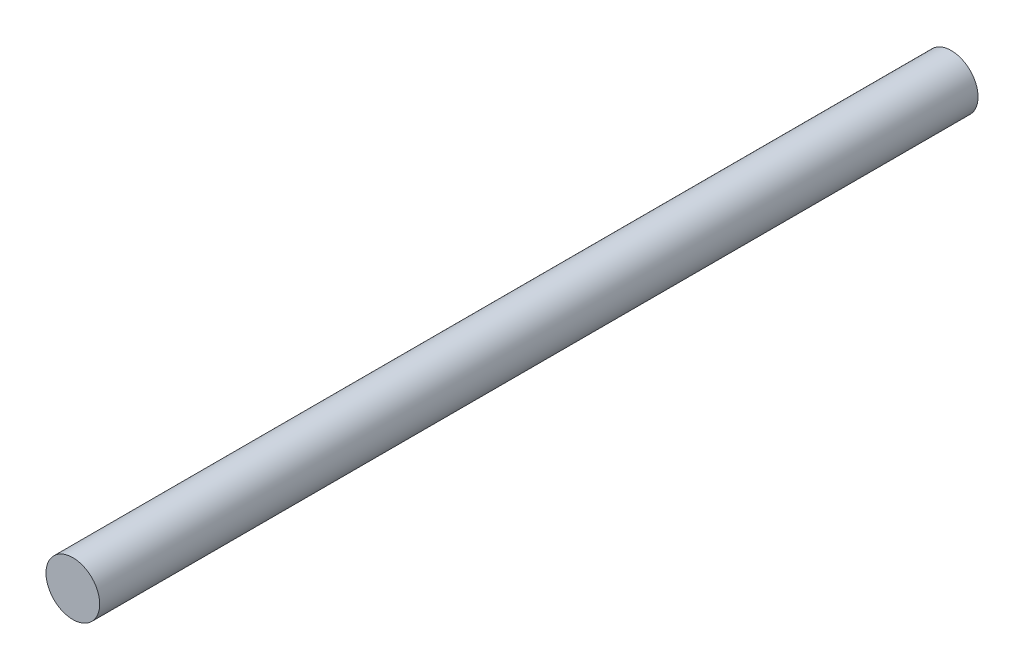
ISO-10303-21;
HEADER;
FILE_DESCRIPTION(('STEP AP214'),'2;1');
FILE_NAME('part.step','',(''),(''),'','','');
FILE_SCHEMA(('AUTOMOTIVE_DESIGN { 1 0 10303 214 1 1 1 1 }'));
ENDSEC;
DATA;
#1=APPLICATION_CONTEXT('core data for automotive mechanical design processes');
#2=APPLICATION_PROTOCOL_DEFINITION('international standard','automotive_design',2000,#1);
#3=PRODUCT_CONTEXT('',#1,'mechanical');
#4=PRODUCT('Part','Part','',(#3));
#5=PRODUCT_RELATED_PRODUCT_CATEGORY('part','',(#4));
#6=PRODUCT_DEFINITION_FORMATION('','',#4);
#7=PRODUCT_DEFINITION_CONTEXT('part definition',#1,'design');
#8=PRODUCT_DEFINITION('design','',#6,#7);
#9=PRODUCT_DEFINITION_SHAPE('','',#8);
#10=(LENGTH_UNIT() NAMED_UNIT(*) SI_UNIT(.MILLI.,.METRE.));
#11=(NAMED_UNIT(*) PLANE_ANGLE_UNIT() SI_UNIT($,.RADIAN.));
#12=(NAMED_UNIT(*) SI_UNIT($,.STERADIAN.) SOLID_ANGLE_UNIT());
#13=UNCERTAINTY_MEASURE_WITH_UNIT(LENGTH_MEASURE(1.E-05),#10,'distance_accuracy_value','');
#14=(GEOMETRIC_REPRESENTATION_CONTEXT(3) GLOBAL_UNCERTAINTY_ASSIGNED_CONTEXT((#13)) GLOBAL_UNIT_ASSIGNED_CONTEXT((#10,
#11,#12)) REPRESENTATION_CONTEXT('',''));
#15=CARTESIAN_POINT('',(0.,0.,0.));
#16=DIRECTION('',(0.,0.,1.));
#17=DIRECTION('',(1.,0.,0.));
#18=AXIS2_PLACEMENT_3D('',#15,#16,#17);
#19=CARTESIAN_POINT('',(0.,0.,90.));
#20=DIRECTION('',(0.,0.,-1.));
#21=DIRECTION('',(-1.,0.,0.));
#22=AXIS2_PLACEMENT_3D('',#19,#20,#21);
#23=CYLINDRICAL_SURFACE('',#22,2.75);
#24=CARTESIAN_POINT('',(0.,0.,90.));
#25=DIRECTION('',(0.,0.,1.));
#26=DIRECTION('',(1.,0.,0.));
#27=AXIS2_PLACEMENT_3D('',#24,#25,#26);
#28=CIRCLE('',#27,2.75);
#29=CARTESIAN_POINT('',(-2.75,0.,90.));
#30=VERTEX_POINT('',#29);
#31=EDGE_CURVE('E10',#30,#30,#28,.T.);
#32=CARTESIAN_POINT('',(0.,0.,0.));
#33=DIRECTION('',(0.,0.,1.));
#34=DIRECTION('',(1.,0.,0.));
#35=AXIS2_PLACEMENT_3D('',#32,#33,#34);
#36=CIRCLE('',#35,2.75);
#37=CARTESIAN_POINT('',(-2.75,0.,0.));
#38=VERTEX_POINT('',#37);
#39=EDGE_CURVE('E34',#38,#38,#36,.T.);
#40=CARTESIAN_POINT('',(-2.75,0.,90.));
#41=CARTESIAN_POINT('',(-2.75,0.,89.0625));
#42=CARTESIAN_POINT('',(-2.75,0.,88.125));
#43=CARTESIAN_POINT('',(-2.75,0.,86.25));
#44=CARTESIAN_POINT('',(-2.75,0.,85.3125));
#45=CARTESIAN_POINT('',(-2.75,0.,83.4375));
#46=CARTESIAN_POINT('',(-2.75,0.,82.5));
#47=CARTESIAN_POINT('',(-2.75,0.,80.625));
#48=CARTESIAN_POINT('',(-2.75,0.,79.6875));
#49=CARTESIAN_POINT('',(-2.75,0.,77.8125));
#50=CARTESIAN_POINT('',(-2.75,0.,76.875));
#51=CARTESIAN_POINT('',(-2.75,0.,75.));
#52=CARTESIAN_POINT('',(-2.75,0.,74.0625));
#53=CARTESIAN_POINT('',(-2.75,0.,72.1875));
#54=CARTESIAN_POINT('',(-2.75,0.,71.25));
#55=CARTESIAN_POINT('',(-2.75,0.,69.375));
#56=CARTESIAN_POINT('',(-2.75,0.,68.4375));
#57=CARTESIAN_POINT('',(-2.75,0.,66.5625));
#58=CARTESIAN_POINT('',(-2.75,0.,65.625));
#59=CARTESIAN_POINT('',(-2.75,0.,63.75));
#60=CARTESIAN_POINT('',(-2.75,0.,62.8125));
#61=CARTESIAN_POINT('',(-2.75,0.,60.9375));
#62=CARTESIAN_POINT('',(-2.75,0.,60.));
#63=CARTESIAN_POINT('',(-2.75,0.,58.125));
#64=CARTESIAN_POINT('',(-2.75,0.,57.1875));
#65=CARTESIAN_POINT('',(-2.75,0.,55.3125));
#66=CARTESIAN_POINT('',(-2.75,0.,54.375));
#67=CARTESIAN_POINT('',(-2.75,0.,52.5));
#68=CARTESIAN_POINT('',(-2.75,0.,51.5625));
#69=CARTESIAN_POINT('',(-2.75,0.,49.6875));
#70=CARTESIAN_POINT('',(-2.75,0.,48.75));
#71=CARTESIAN_POINT('',(-2.75,0.,46.875));
#72=CARTESIAN_POINT('',(-2.75,0.,45.9375));
#73=CARTESIAN_POINT('',(-2.75,0.,44.0625));
#74=CARTESIAN_POINT('',(-2.75,0.,43.125));
#75=CARTESIAN_POINT('',(-2.75,0.,41.25));
#76=CARTESIAN_POINT('',(-2.75,0.,40.3125));
#77=CARTESIAN_POINT('',(-2.75,0.,38.4375));
#78=CARTESIAN_POINT('',(-2.75,0.,37.5));
#79=CARTESIAN_POINT('',(-2.75,0.,35.625));
#80=CARTESIAN_POINT('',(-2.75,0.,34.6875));
#81=CARTESIAN_POINT('',(-2.75,0.,32.8125));
#82=CARTESIAN_POINT('',(-2.75,0.,31.875));
#83=CARTESIAN_POINT('',(-2.75,0.,30.));
#84=CARTESIAN_POINT('',(-2.75,0.,29.0625));
#85=CARTESIAN_POINT('',(-2.75,0.,27.1875));
#86=CARTESIAN_POINT('',(-2.75,0.,26.25));
#87=CARTESIAN_POINT('',(-2.75,0.,24.375));
#88=CARTESIAN_POINT('',(-2.75,0.,23.4375));
#89=CARTESIAN_POINT('',(-2.75,0.,21.5625));
#90=CARTESIAN_POINT('',(-2.75,0.,20.625));
#91=CARTESIAN_POINT('',(-2.75,0.,18.75));
#92=CARTESIAN_POINT('',(-2.75,0.,17.8125));
#93=CARTESIAN_POINT('',(-2.75,0.,15.9375));
#94=CARTESIAN_POINT('',(-2.75,0.,15.));
#95=CARTESIAN_POINT('',(-2.75,0.,13.125));
#96=CARTESIAN_POINT('',(-2.75,0.,12.1875));
#97=CARTESIAN_POINT('',(-2.75,0.,10.3125));
#98=CARTESIAN_POINT('',(-2.75,0.,9.37499999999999));
#99=CARTESIAN_POINT('',(-2.75,0.,7.49999999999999));
#100=CARTESIAN_POINT('',(-2.75,0.,6.56249999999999));
#101=CARTESIAN_POINT('',(-2.75,0.,4.68749999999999));
#102=CARTESIAN_POINT('',(-2.75,0.,3.74999999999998));
#103=CARTESIAN_POINT('',(-2.75,0.,1.87499999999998));
#104=CARTESIAN_POINT('',(-2.75,0.,0.937499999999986));
#105=CARTESIAN_POINT('',(-2.75,0.,0.));
#106=B_SPLINE_CURVE_WITH_KNOTS('',3,(#40,#41,#42,#43,#44,#45,#46,#47,#48,#49,#50,#51,#52,#53,
#54,#55,#56,#57,#58,#59,#60,#61,#62,#63,#64,#65,#66,#67,#68,#69,#70,#71,#72,#73,#74,#75,#76,#77,
#78,#79,#80,#81,#82,#83,#84,#85,#86,#87,#88,#89,#90,#91,#92,#93,#94,#95,#96,#97,#98,#99,#100,
#101,#102,#103,#104,#105),.UNSPECIFIED.,.F.,.F.,(4,2,2,2,2,2,2,2,2,2,2,2,2,2,2,2,2,2,2,2,2,2,2,
2,2,2,2,2,2,2,2,2,4),(0.,2.81250000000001,5.62500000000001,8.43750000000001,11.25,14.0625,
16.875,19.6875,22.5,25.3125,28.125,30.9375,33.75,36.5625,39.375,42.1875,45.,47.8125,50.625,
53.4375,56.25,59.0625,61.875,64.6875,67.5,70.3125,73.125,75.9375,78.75,81.5625,84.375,87.1875,
90.),.UNSPECIFIED.);
#107=EDGE_CURVE('BSEAM31',#30,#38,#106,.T.);
#108=ORIENTED_EDGE('',*,*,#31,.F.);
#109=ORIENTED_EDGE('',*,*,#39,.T.);
#110=ORIENTED_EDGE('',*,*,#107,.T.);
#111=ORIENTED_EDGE('',*,*,#107,.F.);
#112=EDGE_LOOP('',(#108,#110,#109,#111));
#113=FACE_BOUND('',#112,.T.);
#114=ADVANCED_FACE('F31',(#113),#23,.T.);
#115=CARTESIAN_POINT('',(0.,0.,90.));
#116=DIRECTION('',(0.,0.,1.));
#117=DIRECTION('',(1.,0.,0.));
#118=AXIS2_PLACEMENT_3D('',#115,#116,#117);
#119=PLANE('',#118);
#120=ORIENTED_EDGE('',*,*,#31,.T.);
#121=EDGE_LOOP('',(#120));
#122=FACE_BOUND('',#121,.T.);
#123=ADVANCED_FACE('F46',(#122),#119,.T.);
#124=CARTESIAN_POINT('',(0.,0.,0.));
#125=DIRECTION('',(0.,0.,1.));
#126=DIRECTION('',(1.,0.,0.));
#127=AXIS2_PLACEMENT_3D('',#124,#125,#126);
#128=PLANE('',#127);
#129=ORIENTED_EDGE('',*,*,#39,.F.);
#130=EDGE_LOOP('',(#129));
#131=FACE_BOUND('',#130,.T.);
#132=ADVANCED_FACE('F44',(#131),#128,.F.);
#133=CLOSED_SHELL('',(#114,#123,#132));
#134=MANIFOLD_SOLID_BREP('B2',#133);
#135=ADVANCED_BREP_SHAPE_REPRESENTATION('',(#18,#134),#14);
#136=SHAPE_DEFINITION_REPRESENTATION(#9,#135);
ENDSEC;
END-ISO-10303-21;
